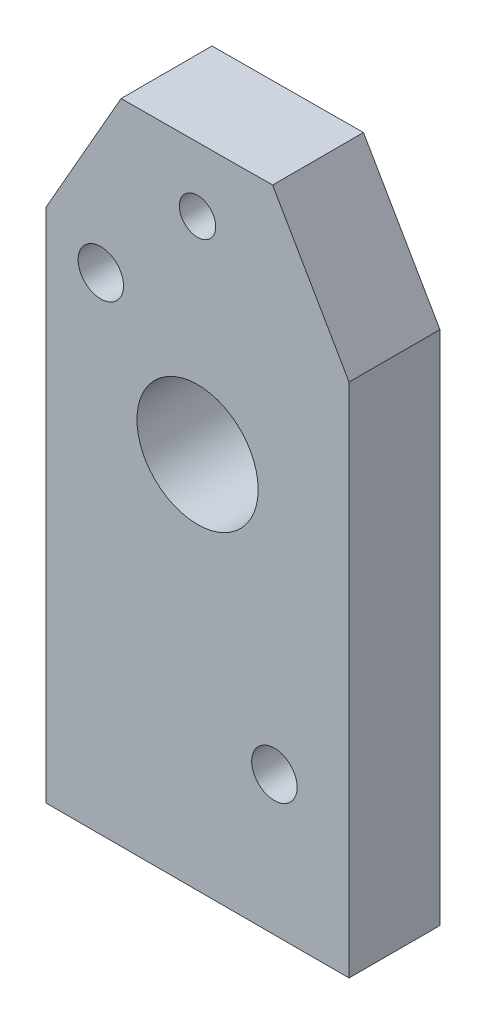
ISO-10303-21;
HEADER;
FILE_DESCRIPTION(('STEP AP214'),'2;1');
FILE_NAME('part.step','',(''),(''),'','','');
FILE_SCHEMA(('AUTOMOTIVE_DESIGN { 1 0 10303 214 1 1 1 1 }'));
ENDSEC;
DATA;
#1=APPLICATION_CONTEXT('core data for automotive mechanical design processes');
#2=APPLICATION_PROTOCOL_DEFINITION('international standard','automotive_design',2000,#1);
#3=PRODUCT_CONTEXT('',#1,'mechanical');
#4=PRODUCT('Part','Part','',(#3));
#5=PRODUCT_RELATED_PRODUCT_CATEGORY('part','',(#4));
#6=PRODUCT_DEFINITION_FORMATION('','',#4);
#7=PRODUCT_DEFINITION_CONTEXT('part definition',#1,'design');
#8=PRODUCT_DEFINITION('design','',#6,#7);
#9=PRODUCT_DEFINITION_SHAPE('','',#8);
#10=(LENGTH_UNIT() NAMED_UNIT(*) SI_UNIT(.MILLI.,.METRE.));
#11=(NAMED_UNIT(*) PLANE_ANGLE_UNIT() SI_UNIT($,.RADIAN.));
#12=(NAMED_UNIT(*) SI_UNIT($,.STERADIAN.) SOLID_ANGLE_UNIT());
#13=UNCERTAINTY_MEASURE_WITH_UNIT(LENGTH_MEASURE(1.E-05),#10,'distance_accuracy_value','');
#14=(GEOMETRIC_REPRESENTATION_CONTEXT(3) GLOBAL_UNCERTAINTY_ASSIGNED_CONTEXT((#13)) GLOBAL_UNIT_ASSIGNED_CONTEXT((#10,
#11,#12)) REPRESENTATION_CONTEXT('',''));
#15=CARTESIAN_POINT('',(0.,0.,0.));
#16=DIRECTION('',(0.,0.,1.));
#17=DIRECTION('',(1.,0.,0.));
#18=AXIS2_PLACEMENT_3D('',#15,#16,#17);
#19=CARTESIAN_POINT('',(16.2660522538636,42.0023688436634,6.));
#20=DIRECTION('',(0.,0.,-1.));
#21=DIRECTION('',(-1.,0.,0.));
#22=AXIS2_PLACEMENT_3D('',#19,#20,#21);
#23=PLANE('',#22);
#24=CARTESIAN_POINT('',(6.26605225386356,80.5423746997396,6.));
#25=DIRECTION('',(0.,0.,1.));
#26=DIRECTION('',(1.,0.,0.));
#27=AXIS2_PLACEMENT_3D('',#24,#25,#26);
#28=CIRCLE('',#27,1.2);
#29=CARTESIAN_POINT('',(7.46605225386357,80.5423746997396,6.));
#30=VERTEX_POINT('',#29);
#31=EDGE_CURVE('E180',#30,#30,#28,.T.);
#32=ORIENTED_EDGE('',*,*,#31,.F.);
#33=EDGE_LOOP('',(#32));
#34=FACE_BOUND('',#33,.T.);
#35=CARTESIAN_POINT('',(-0.120078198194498,74.1210871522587,6.));
#36=DIRECTION('',(0.,0.,1.));
#37=DIRECTION('',(1.,0.,0.));
#38=AXIS2_PLACEMENT_3D('',#35,#36,#37);
#39=CIRCLE('',#38,1.5);
#40=CARTESIAN_POINT('',(1.3799218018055,74.1210871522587,6.));
#41=VERTEX_POINT('',#40);
#42=EDGE_CURVE('E191',#41,#41,#39,.T.);
#43=ORIENTED_EDGE('',*,*,#42,.F.);
#44=EDGE_LOOP('',(#43));
#45=FACE_BOUND('',#44,.T.);
#46=DIRECTION('',(0.,1.,0.));
#47=VECTOR('',#46,1.);
#48=CARTESIAN_POINT('',(16.2660522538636,42.0023688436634,6.));
#49=LINE('',#48,#47);
#50=CARTESIAN_POINT('',(16.2660522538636,42.0023688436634,6.));
#51=VERTEX_POINT('',#50);
#52=CARTESIAN_POINT('',(16.2660522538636,76.0673500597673,6.));
#53=VERTEX_POINT('',#52);
#54=EDGE_CURVE('E126',#51,#53,#49,.T.);
#55=ORIENTED_EDGE('',*,*,#54,.T.);
#56=DIRECTION('',(-0.500000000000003,0.866025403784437,0.));
#57=VECTOR('',#56,1.);
#58=CARTESIAN_POINT('',(16.2660522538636,76.0673500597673,6.));
#59=LINE('',#58,#57);
#60=CARTESIAN_POINT('',(11.2195145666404,84.8082097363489,6.));
#61=VERTEX_POINT('',#60);
#62=EDGE_CURVE('E84',#53,#61,#59,.T.);
#63=ORIENTED_EDGE('',*,*,#62,.T.);
#64=DIRECTION('',(-0.999985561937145,-0.00537363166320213,0.));
#65=VECTOR('',#64,1.);
#66=CARTESIAN_POINT('',(11.2195145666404,84.8082097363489,6.));
#67=LINE('',#66,#65);
#68=CARTESIAN_POINT('',(1.21951456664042,84.7544726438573,6.));
#69=VERTEX_POINT('',#68);
#70=EDGE_CURVE('E97',#61,#69,#67,.T.);
#71=ORIENTED_EDGE('',*,*,#70,.T.);
#72=DIRECTION('',(-0.495339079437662,-0.868699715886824,0.));
#73=VECTOR('',#72,1.);
#74=CARTESIAN_POINT('',(1.21951456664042,84.7544726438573,6.));
#75=LINE('',#74,#73);
#76=CARTESIAN_POINT('',(-3.73394774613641,76.0673500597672,6.));
#77=VERTEX_POINT('',#76);
#78=EDGE_CURVE('E91',#69,#77,#75,.T.);
#79=ORIENTED_EDGE('',*,*,#78,.T.);
#80=DIRECTION('',(0.,-1.,0.));
#81=VECTOR('',#80,1.);
#82=CARTESIAN_POINT('',(-3.73394774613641,76.0673500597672,6.));
#83=LINE('',#82,#81);
#84=CARTESIAN_POINT('',(-3.73394774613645,42.0023688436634,6.));
#85=VERTEX_POINT('',#84);
#86=EDGE_CURVE('E95',#77,#85,#83,.T.);
#87=ORIENTED_EDGE('',*,*,#86,.T.);
#88=DIRECTION('',(1.,0.,0.));
#89=VECTOR('',#88,1.);
#90=CARTESIAN_POINT('',(-3.73394774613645,42.0023688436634,6.));
#91=LINE('',#90,#89);
#92=EDGE_CURVE('E47',#85,#51,#91,.T.);
#93=ORIENTED_EDGE('',*,*,#92,.T.);
#94=EDGE_LOOP('',(#55,#63,#71,#79,#87,#93));
#95=FACE_BOUND('',#94,.T.);
#96=CARTESIAN_POINT('',(11.3399218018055,51.1820448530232,6.));
#97=DIRECTION('',(0.,0.,1.));
#98=DIRECTION('',(1.,0.,0.));
#99=AXIS2_PLACEMENT_3D('',#96,#97,#98);
#100=CIRCLE('',#99,1.5);
#101=CARTESIAN_POINT('',(12.8399218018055,51.1820448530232,6.));
#102=VERTEX_POINT('',#101);
#103=EDGE_CURVE('E119',#102,#102,#100,.T.);
#104=ORIENTED_EDGE('',*,*,#103,.F.);
#105=EDGE_LOOP('',(#104));
#106=FACE_BOUND('',#105,.T.);
#107=CARTESIAN_POINT('',(6.26605225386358,66.9260589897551,6.));
#108=DIRECTION('',(0.,0.,1.));
#109=DIRECTION('',(1.,0.,0.));
#110=AXIS2_PLACEMENT_3D('',#107,#108,#109);
#111=CIRCLE('',#110,4.);
#112=CARTESIAN_POINT('',(10.2660522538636,66.9260589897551,6.));
#113=VERTEX_POINT('',#112);
#114=EDGE_CURVE('E185',#113,#113,#111,.T.);
#115=ORIENTED_EDGE('',*,*,#114,.F.);
#116=EDGE_LOOP('',(#115));
#117=FACE_BOUND('',#116,.T.);
#118=ADVANCED_FACE('F30',(#34,#45,#95,#106,#117),#23,.F.);
#119=CARTESIAN_POINT('',(16.2660522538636,42.0023688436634,0.));
#120=DIRECTION('',(0.,0.,-1.));
#121=DIRECTION('',(-1.,0.,0.));
#122=AXIS2_PLACEMENT_3D('',#119,#120,#121);
#123=PLANE('',#122);
#124=CARTESIAN_POINT('',(6.26605225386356,80.5423746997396,0.));
#125=DIRECTION('',(0.,0.,1.));
#126=DIRECTION('',(1.,0.,0.));
#127=AXIS2_PLACEMENT_3D('',#124,#125,#126);
#128=CIRCLE('',#127,1.2);
#129=CARTESIAN_POINT('',(7.46605225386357,80.5423746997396,0.));
#130=VERTEX_POINT('',#129);
#131=EDGE_CURVE('E178',#130,#130,#128,.T.);
#132=ORIENTED_EDGE('',*,*,#131,.T.);
#133=EDGE_LOOP('',(#132));
#134=FACE_BOUND('',#133,.T.);
#135=CARTESIAN_POINT('',(-0.120078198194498,74.1210871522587,0.));
#136=DIRECTION('',(0.,0.,1.));
#137=DIRECTION('',(1.,0.,0.));
#138=AXIS2_PLACEMENT_3D('',#135,#136,#137);
#139=CIRCLE('',#138,1.5);
#140=CARTESIAN_POINT('',(1.3799218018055,74.1210871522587,0.));
#141=VERTEX_POINT('',#140);
#142=EDGE_CURVE('E188',#141,#141,#139,.T.);
#143=ORIENTED_EDGE('',*,*,#142,.T.);
#144=EDGE_LOOP('',(#143));
#145=FACE_BOUND('',#144,.T.);
#146=DIRECTION('',(0.,1.,0.));
#147=VECTOR('',#146,1.);
#148=CARTESIAN_POINT('',(16.2660522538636,42.0023688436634,0.));
#149=LINE('',#148,#147);
#150=CARTESIAN_POINT('',(16.2660522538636,42.0023688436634,0.));
#151=VERTEX_POINT('',#150);
#152=CARTESIAN_POINT('',(16.2660522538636,76.0673500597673,0.));
#153=VERTEX_POINT('',#152);
#154=EDGE_CURVE('E115',#151,#153,#149,.T.);
#155=ORIENTED_EDGE('',*,*,#154,.F.);
#156=DIRECTION('',(1.,0.,0.));
#157=VECTOR('',#156,1.);
#158=CARTESIAN_POINT('',(-3.73394774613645,42.0023688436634,0.));
#159=LINE('',#158,#157);
#160=CARTESIAN_POINT('',(-3.73394774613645,42.0023688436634,0.));
#161=VERTEX_POINT('',#160);
#162=EDGE_CURVE('E76',#161,#151,#159,.T.);
#163=ORIENTED_EDGE('',*,*,#162,.F.);
#164=DIRECTION('',(0.,-1.,0.));
#165=VECTOR('',#164,1.);
#166=CARTESIAN_POINT('',(-3.73394774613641,76.0673500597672,0.));
#167=LINE('',#166,#165);
#168=CARTESIAN_POINT('',(-3.73394774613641,76.0673500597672,0.));
#169=VERTEX_POINT('',#168);
#170=EDGE_CURVE('E70',#169,#161,#167,.T.);
#171=ORIENTED_EDGE('',*,*,#170,.F.);
#172=DIRECTION('',(-0.495339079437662,-0.868699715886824,0.));
#173=VECTOR('',#172,1.);
#174=CARTESIAN_POINT('',(1.21951456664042,84.7544726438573,0.));
#175=LINE('',#174,#173);
#176=CARTESIAN_POINT('',(1.21951456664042,84.7544726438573,0.));
#177=VERTEX_POINT('',#176);
#178=EDGE_CURVE('E105',#177,#169,#175,.T.);
#179=ORIENTED_EDGE('',*,*,#178,.F.);
#180=DIRECTION('',(-0.999985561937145,-0.00537363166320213,0.));
#181=VECTOR('',#180,1.);
#182=CARTESIAN_POINT('',(11.2195145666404,84.8082097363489,0.));
#183=LINE('',#182,#181);
#184=CARTESIAN_POINT('',(11.2195145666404,84.8082097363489,0.));
#185=VERTEX_POINT('',#184);
#186=EDGE_CURVE('E121',#185,#177,#183,.T.);
#187=ORIENTED_EDGE('',*,*,#186,.F.);
#188=DIRECTION('',(-0.500000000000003,0.866025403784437,0.));
#189=VECTOR('',#188,1.);
#190=CARTESIAN_POINT('',(16.2660522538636,76.0673500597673,0.));
#191=LINE('',#190,#189);
#192=EDGE_CURVE('E118',#153,#185,#191,.T.);
#193=ORIENTED_EDGE('',*,*,#192,.F.);
#194=EDGE_LOOP('',(#155,#163,#171,#179,#187,#193));
#195=FACE_BOUND('',#194,.T.);
#196=CARTESIAN_POINT('',(11.3399218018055,51.1820448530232,0.));
#197=DIRECTION('',(0.,0.,1.));
#198=DIRECTION('',(1.,0.,0.));
#199=AXIS2_PLACEMENT_3D('',#196,#197,#198);
#200=CIRCLE('',#199,1.5);
#201=CARTESIAN_POINT('',(12.8399218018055,51.1820448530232,0.));
#202=VERTEX_POINT('',#201);
#203=EDGE_CURVE('E194',#202,#202,#200,.T.);
#204=ORIENTED_EDGE('',*,*,#203,.T.);
#205=EDGE_LOOP('',(#204));
#206=FACE_BOUND('',#205,.T.);
#207=CARTESIAN_POINT('',(6.26605225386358,66.9260589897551,0.));
#208=DIRECTION('',(0.,0.,1.));
#209=DIRECTION('',(1.,0.,0.));
#210=AXIS2_PLACEMENT_3D('',#207,#208,#209);
#211=CIRCLE('',#210,4.);
#212=CARTESIAN_POINT('',(10.2660522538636,66.9260589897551,0.));
#213=VERTEX_POINT('',#212);
#214=EDGE_CURVE('E182',#213,#213,#211,.T.);
#215=ORIENTED_EDGE('',*,*,#214,.T.);
#216=EDGE_LOOP('',(#215));
#217=FACE_BOUND('',#216,.T.);
#218=ADVANCED_FACE('F135',(#134,#145,#195,#206,#217),#123,.T.);
#219=CARTESIAN_POINT('',(16.2660522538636,42.0023688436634,6.));
#220=DIRECTION('',(-1.,0.,0.));
#221=DIRECTION('',(0.,-1.,0.));
#222=AXIS2_PLACEMENT_3D('',#219,#220,#221);
#223=PLANE('',#222);
#224=ORIENTED_EDGE('',*,*,#154,.T.);
#225=DIRECTION('',(0.,0.,-1.));
#226=VECTOR('',#225,1.);
#227=CARTESIAN_POINT('',(16.2660522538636,76.0673500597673,6.));
#228=LINE('',#227,#226);
#229=EDGE_CURVE('E11',#53,#153,#228,.T.);
#230=ORIENTED_EDGE('',*,*,#229,.F.);
#231=ORIENTED_EDGE('',*,*,#54,.F.);
#232=DIRECTION('',(0.,0.,-1.));
#233=VECTOR('',#232,1.);
#234=CARTESIAN_POINT('',(16.2660522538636,42.0023688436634,6.));
#235=LINE('',#234,#233);
#236=EDGE_CURVE('E111',#51,#151,#235,.T.);
#237=ORIENTED_EDGE('',*,*,#236,.T.);
#238=EDGE_LOOP('',(#224,#230,#231,#237));
#239=FACE_BOUND('',#238,.T.);
#240=ADVANCED_FACE('F32',(#239),#223,.F.);
#241=CARTESIAN_POINT('',(16.2660522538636,76.0673500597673,6.));
#242=DIRECTION('',(-0.866025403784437,-0.500000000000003,0.));
#243=DIRECTION('',(0.500000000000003,-0.866025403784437,0.));
#244=AXIS2_PLACEMENT_3D('',#241,#242,#243);
#245=PLANE('',#244);
#246=ORIENTED_EDGE('',*,*,#192,.T.);
#247=DIRECTION('',(0.,0.,-1.));
#248=VECTOR('',#247,1.);
#249=CARTESIAN_POINT('',(11.2195145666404,84.8082097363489,6.));
#250=LINE('',#249,#248);
#251=EDGE_CURVE('E39',#61,#185,#250,.T.);
#252=ORIENTED_EDGE('',*,*,#251,.F.);
#253=ORIENTED_EDGE('',*,*,#62,.F.);
#254=ORIENTED_EDGE('',*,*,#229,.T.);
#255=EDGE_LOOP('',(#246,#252,#253,#254));
#256=FACE_BOUND('',#255,.T.);
#257=ADVANCED_FACE('F254',(#256),#245,.F.);
#258=CARTESIAN_POINT('',(11.2195145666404,84.8082097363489,6.));
#259=DIRECTION('',(0.00537363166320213,-0.999985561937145,0.));
#260=DIRECTION('',(0.999985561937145,0.00537363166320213,0.));
#261=AXIS2_PLACEMENT_3D('',#258,#259,#260);
#262=PLANE('',#261);
#263=ORIENTED_EDGE('',*,*,#186,.T.);
#264=DIRECTION('',(0.,0.,-1.));
#265=VECTOR('',#264,1.);
#266=CARTESIAN_POINT('',(1.21951456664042,84.7544726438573,6.));
#267=LINE('',#266,#265);
#268=EDGE_CURVE('E106',#69,#177,#267,.T.);
#269=ORIENTED_EDGE('',*,*,#268,.F.);
#270=ORIENTED_EDGE('',*,*,#70,.F.);
#271=ORIENTED_EDGE('',*,*,#251,.T.);
#272=EDGE_LOOP('',(#263,#269,#270,#271));
#273=FACE_BOUND('',#272,.T.);
#274=ADVANCED_FACE('F132',(#273),#262,.F.);
#275=CARTESIAN_POINT('',(1.21951456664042,84.7544726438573,6.));
#276=DIRECTION('',(0.868699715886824,-0.495339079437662,0.));
#277=DIRECTION('',(0.495339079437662,0.868699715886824,0.));
#278=AXIS2_PLACEMENT_3D('',#275,#276,#277);
#279=PLANE('',#278);
#280=ORIENTED_EDGE('',*,*,#178,.T.);
#281=DIRECTION('',(0.,0.,-1.));
#282=VECTOR('',#281,1.);
#283=CARTESIAN_POINT('',(-3.73394774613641,76.0673500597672,6.));
#284=LINE('',#283,#282);
#285=EDGE_CURVE('E102',#77,#169,#284,.T.);
#286=ORIENTED_EDGE('',*,*,#285,.F.);
#287=ORIENTED_EDGE('',*,*,#78,.F.);
#288=ORIENTED_EDGE('',*,*,#268,.T.);
#289=EDGE_LOOP('',(#280,#286,#287,#288));
#290=FACE_BOUND('',#289,.T.);
#291=ADVANCED_FACE('F103',(#290),#279,.F.);
#292=CARTESIAN_POINT('',(-3.73394774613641,76.0673500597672,6.));
#293=DIRECTION('',(1.,0.,0.));
#294=DIRECTION('',(0.,1.,0.));
#295=AXIS2_PLACEMENT_3D('',#292,#293,#294);
#296=PLANE('',#295);
#297=ORIENTED_EDGE('',*,*,#170,.T.);
#298=DIRECTION('',(0.,0.,-1.));
#299=VECTOR('',#298,1.);
#300=CARTESIAN_POINT('',(-3.73394774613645,42.0023688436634,6.));
#301=LINE('',#300,#299);
#302=EDGE_CURVE('E107',#85,#161,#301,.T.);
#303=ORIENTED_EDGE('',*,*,#302,.F.);
#304=ORIENTED_EDGE('',*,*,#86,.F.);
#305=ORIENTED_EDGE('',*,*,#285,.T.);
#306=EDGE_LOOP('',(#297,#303,#304,#305));
#307=FACE_BOUND('',#306,.T.);
#308=ADVANCED_FACE('F109',(#307),#296,.F.);
#309=CARTESIAN_POINT('',(-3.73394774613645,42.0023688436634,6.));
#310=DIRECTION('',(0.,1.,0.));
#311=DIRECTION('',(0.,0.,1.));
#312=AXIS2_PLACEMENT_3D('',#309,#310,#311);
#313=PLANE('',#312);
#314=ORIENTED_EDGE('',*,*,#162,.T.);
#315=ORIENTED_EDGE('',*,*,#236,.F.);
#316=ORIENTED_EDGE('',*,*,#92,.F.);
#317=ORIENTED_EDGE('',*,*,#302,.T.);
#318=EDGE_LOOP('',(#314,#315,#316,#317));
#319=FACE_BOUND('',#318,.T.);
#320=ADVANCED_FACE('F140',(#319),#313,.F.);
#321=CARTESIAN_POINT('',(11.3399218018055,51.1820448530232,6.));
#322=DIRECTION('',(0.,0.,-1.));
#323=DIRECTION('',(-1.,0.,0.));
#324=AXIS2_PLACEMENT_3D('',#321,#322,#323);
#325=CYLINDRICAL_SURFACE('',#324,1.5);
#326=ORIENTED_EDGE('',*,*,#103,.T.);
#327=EDGE_LOOP('',(#326));
#328=FACE_BOUND('',#327,.T.);
#329=ORIENTED_EDGE('',*,*,#203,.F.);
#330=EDGE_LOOP('',(#329));
#331=FACE_BOUND('',#330,.T.);
#332=ADVANCED_FACE('F142',(#328,#331),#325,.F.);
#333=CARTESIAN_POINT('',(-0.120078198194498,74.1210871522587,6.));
#334=DIRECTION('',(0.,0.,-1.));
#335=DIRECTION('',(-1.,0.,0.));
#336=AXIS2_PLACEMENT_3D('',#333,#334,#335);
#337=CYLINDRICAL_SURFACE('',#336,1.5);
#338=ORIENTED_EDGE('',*,*,#42,.T.);
#339=EDGE_LOOP('',(#338));
#340=FACE_BOUND('',#339,.T.);
#341=ORIENTED_EDGE('',*,*,#142,.F.);
#342=EDGE_LOOP('',(#341));
#343=FACE_BOUND('',#342,.T.);
#344=ADVANCED_FACE('F148',(#340,#343),#337,.F.);
#345=CARTESIAN_POINT('',(6.26605225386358,66.9260589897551,6.));
#346=DIRECTION('',(0.,0.,-1.));
#347=DIRECTION('',(-1.,0.,0.));
#348=AXIS2_PLACEMENT_3D('',#345,#346,#347);
#349=CYLINDRICAL_SURFACE('',#348,4.);
#350=ORIENTED_EDGE('',*,*,#114,.T.);
#351=EDGE_LOOP('',(#350));
#352=FACE_BOUND('',#351,.T.);
#353=ORIENTED_EDGE('',*,*,#214,.F.);
#354=EDGE_LOOP('',(#353));
#355=FACE_BOUND('',#354,.T.);
#356=ADVANCED_FACE('F165',(#352,#355),#349,.F.);
#357=CARTESIAN_POINT('',(6.26605225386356,80.5423746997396,0.));
#358=DIRECTION('',(0.,0.,1.));
#359=DIRECTION('',(1.,0.,0.));
#360=AXIS2_PLACEMENT_3D('',#357,#358,#359);
#361=CYLINDRICAL_SURFACE('',#360,1.2);
#362=ORIENTED_EDGE('',*,*,#131,.F.);
#363=EDGE_LOOP('',(#362));
#364=FACE_BOUND('',#363,.T.);
#365=ORIENTED_EDGE('',*,*,#31,.T.);
#366=EDGE_LOOP('',(#365));
#367=FACE_BOUND('',#366,.T.);
#368=ADVANCED_FACE('F169',(#364,#367),#361,.F.);
#369=CLOSED_SHELL('',(#118,#218,#240,#257,#274,#291,#308,#320,#332,#344,#356,#368));
#370=MANIFOLD_SOLID_BREP('B2',#369);
#371=ADVANCED_BREP_SHAPE_REPRESENTATION('',(#18,#370),#14);
#372=SHAPE_DEFINITION_REPRESENTATION(#9,#371);
ENDSEC;
END-ISO-10303-21;
